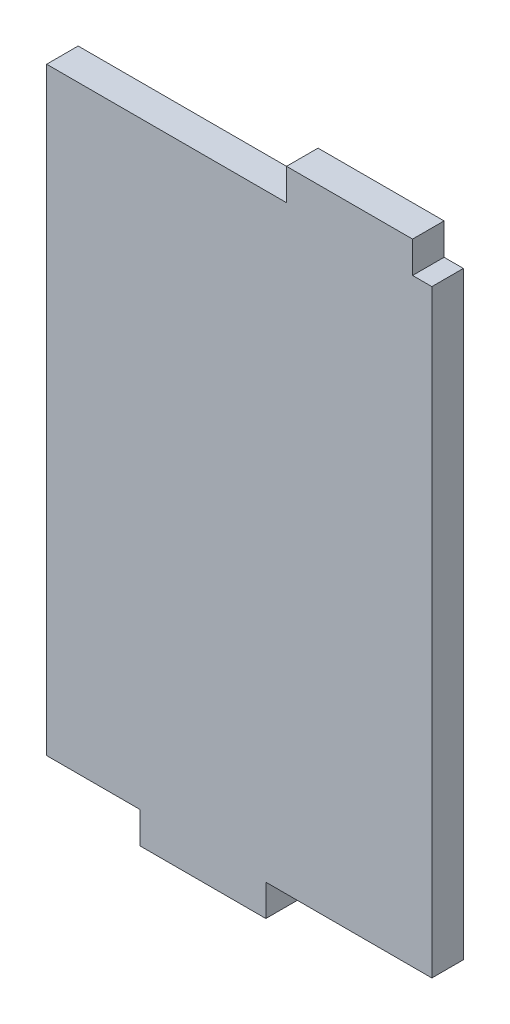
from build123d import *

# Parameters (mm, degrees)
BOSS_EXTRUDE1_DEPTH = 5


with BuildPart() as part:
    # Sketch1 → Boss-Extrude1 (new body)
    with BuildSketch(Plane.XY):
        Polygon((106.56, 100), (106.56, 105), (126.56, 105), (126.56, 100), (129.62, 100), (129.62, 5), (126.56, 5), (103.28, 5), (103.28, 0), (83.28, 0), (83.28, 5), (68.5, 5), (68.5, 100), align=None)
    extrude(amount=BOSS_EXTRUDE1_DEPTH)


solid = part.part
